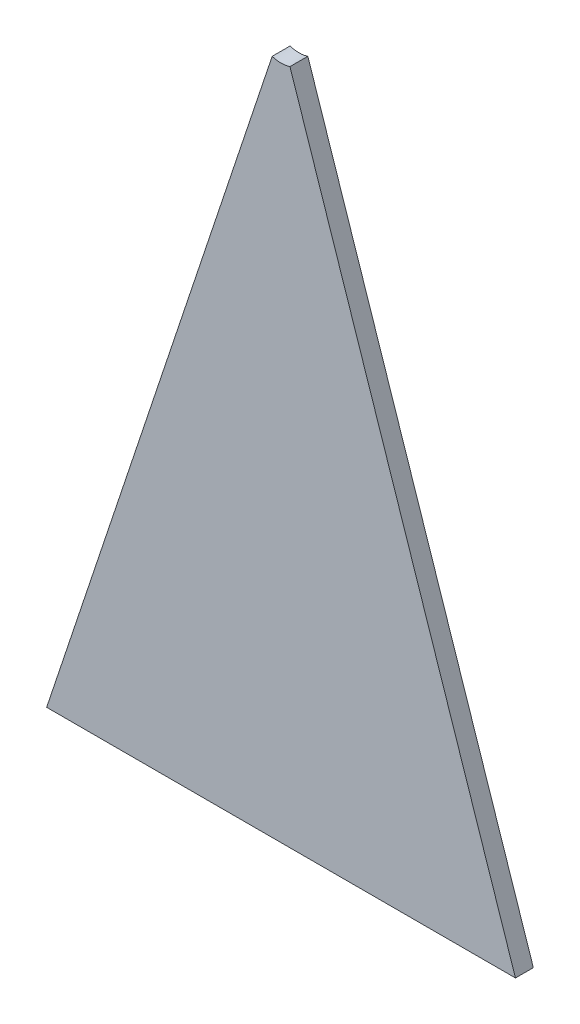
ISO-10303-21;
HEADER;
FILE_DESCRIPTION(('STEP AP214'),'2;1');
FILE_NAME('part.step','',(''),(''),'','','');
FILE_SCHEMA(('AUTOMOTIVE_DESIGN { 1 0 10303 214 1 1 1 1 }'));
ENDSEC;
DATA;
#1=APPLICATION_CONTEXT('core data for automotive mechanical design processes');
#2=APPLICATION_PROTOCOL_DEFINITION('international standard','automotive_design',2000,#1);
#3=PRODUCT_CONTEXT('',#1,'mechanical');
#4=PRODUCT('Part','Part','',(#3));
#5=PRODUCT_RELATED_PRODUCT_CATEGORY('part','',(#4));
#6=PRODUCT_DEFINITION_FORMATION('','',#4);
#7=PRODUCT_DEFINITION_CONTEXT('part definition',#1,'design');
#8=PRODUCT_DEFINITION('design','',#6,#7);
#9=PRODUCT_DEFINITION_SHAPE('','',#8);
#10=(LENGTH_UNIT() NAMED_UNIT(*) SI_UNIT(.MILLI.,.METRE.));
#11=(NAMED_UNIT(*) PLANE_ANGLE_UNIT() SI_UNIT($,.RADIAN.));
#12=(NAMED_UNIT(*) SI_UNIT($,.STERADIAN.) SOLID_ANGLE_UNIT());
#13=UNCERTAINTY_MEASURE_WITH_UNIT(LENGTH_MEASURE(1.E-05),#10,'distance_accuracy_value','');
#14=(GEOMETRIC_REPRESENTATION_CONTEXT(3) GLOBAL_UNCERTAINTY_ASSIGNED_CONTEXT((#13)) GLOBAL_UNIT_ASSIGNED_CONTEXT((#10,
#11,#12)) REPRESENTATION_CONTEXT('',''));
#15=CARTESIAN_POINT('',(0.,0.,0.));
#16=DIRECTION('',(0.,0.,1.));
#17=DIRECTION('',(1.,0.,0.));
#18=AXIS2_PLACEMENT_3D('',#15,#16,#17);
#19=CARTESIAN_POINT('',(500.,0.,19.05));
#20=DIRECTION('',(0.,1.,0.));
#21=DIRECTION('',(-1.,0.,0.));
#22=AXIS2_PLACEMENT_3D('',#19,#20,#21);
#23=PLANE('',#22);
#24=DIRECTION('',(1.,0.,0.));
#25=VECTOR('',#24,1.);
#26=CARTESIAN_POINT('',(500.,0.,0.));
#27=LINE('',#26,#25);
#28=CARTESIAN_POINT('',(0.,0.,0.));
#29=VERTEX_POINT('',#28);
#30=CARTESIAN_POINT('',(500.,0.,0.));
#31=VERTEX_POINT('',#30);
#32=EDGE_CURVE('E113',#29,#31,#27,.T.);
#33=ORIENTED_EDGE('',*,*,#32,.T.);
#34=DIRECTION('',(0.,0.,-1.));
#35=VECTOR('',#34,1.);
#36=CARTESIAN_POINT('',(500.,0.,19.05));
#37=LINE('',#36,#35);
#38=CARTESIAN_POINT('',(500.,0.,19.05));
#39=VERTEX_POINT('',#38);
#40=EDGE_CURVE('E11',#39,#31,#37,.T.);
#41=ORIENTED_EDGE('',*,*,#40,.F.);
#42=DIRECTION('',(1.,0.,0.));
#43=VECTOR('',#42,1.);
#44=CARTESIAN_POINT('',(500.,0.,19.05));
#45=LINE('',#44,#43);
#46=CARTESIAN_POINT('',(0.,0.,19.05));
#47=VERTEX_POINT('',#46);
#48=EDGE_CURVE('E97',#47,#39,#45,.T.);
#49=ORIENTED_EDGE('',*,*,#48,.F.);
#50=DIRECTION('',(0.,0.,-1.));
#51=VECTOR('',#50,1.);
#52=CARTESIAN_POINT('',(0.,0.,19.05));
#53=LINE('',#52,#51);
#54=EDGE_CURVE('E109',#47,#29,#53,.T.);
#55=ORIENTED_EDGE('',*,*,#54,.T.);
#56=EDGE_LOOP('',(#33,#41,#49,#55));
#57=FACE_BOUND('',#56,.T.);
#58=ADVANCED_FACE('F45',(#57),#23,.F.);
#59=CARTESIAN_POINT('',(259.486832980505,721.539501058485,19.05));
#60=DIRECTION('',(-0.948683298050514,-0.316227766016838,0.));
#61=DIRECTION('',(0.316227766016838,-0.948683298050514,0.));
#62=AXIS2_PLACEMENT_3D('',#59,#60,#61);
#63=PLANE('',#62);
#64=DIRECTION('',(-0.316227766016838,0.948683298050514,0.));
#65=VECTOR('',#64,1.);
#66=CARTESIAN_POINT('',(259.486832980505,721.539501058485,0.));
#67=LINE('',#66,#65);
#68=CARTESIAN_POINT('',(259.486832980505,721.539501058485,0.));
#69=VERTEX_POINT('',#68);
#70=EDGE_CURVE('E102',#31,#69,#67,.T.);
#71=ORIENTED_EDGE('',*,*,#70,.T.);
#72=DIRECTION('',(0.,0.,-1.));
#73=VECTOR('',#72,1.);
#74=CARTESIAN_POINT('',(259.486832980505,721.539501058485,19.05));
#75=LINE('',#74,#73);
#76=CARTESIAN_POINT('',(259.486832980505,721.539501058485,19.05));
#77=VERTEX_POINT('',#76);
#78=EDGE_CURVE('E54',#77,#69,#75,.T.);
#79=ORIENTED_EDGE('',*,*,#78,.F.);
#80=DIRECTION('',(-0.316227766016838,0.948683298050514,0.));
#81=VECTOR('',#80,1.);
#82=CARTESIAN_POINT('',(259.486832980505,721.539501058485,19.05));
#83=LINE('',#82,#81);
#84=EDGE_CURVE('E92',#39,#77,#83,.T.);
#85=ORIENTED_EDGE('',*,*,#84,.F.);
#86=ORIENTED_EDGE('',*,*,#40,.T.);
#87=EDGE_LOOP('',(#71,#79,#85,#86));
#88=FACE_BOUND('',#87,.T.);
#89=ADVANCED_FACE('F101',(#88),#63,.F.);
#90=CARTESIAN_POINT('',(250.,750.,19.05));
#91=DIRECTION('',(0.,0.,-1.));
#92=DIRECTION('',(-1.,0.,0.));
#93=AXIS2_PLACEMENT_3D('',#90,#91,#92);
#94=CYLINDRICAL_SURFACE('',#93,30.);
#95=CARTESIAN_POINT('',(250.,750.,0.));
#96=DIRECTION('',(0.,0.,-1.));
#97=DIRECTION('',(1.,0.,0.));
#98=AXIS2_PLACEMENT_3D('',#95,#96,#97);
#99=CIRCLE('',#98,30.);
#100=CARTESIAN_POINT('',(240.513167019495,721.539501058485,0.));
#101=VERTEX_POINT('',#100);
#102=EDGE_CURVE('E79',#69,#101,#99,.T.);
#103=ORIENTED_EDGE('',*,*,#102,.T.);
#104=DIRECTION('',(0.,0.,-1.));
#105=VECTOR('',#104,1.);
#106=CARTESIAN_POINT('',(240.513167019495,721.539501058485,19.05));
#107=LINE('',#106,#105);
#108=CARTESIAN_POINT('',(240.513167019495,721.539501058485,19.05));
#109=VERTEX_POINT('',#108);
#110=EDGE_CURVE('E104',#109,#101,#107,.T.);
#111=ORIENTED_EDGE('',*,*,#110,.F.);
#112=CARTESIAN_POINT('',(250.,750.,19.05));
#113=DIRECTION('',(0.,0.,-1.));
#114=DIRECTION('',(1.,0.,0.));
#115=AXIS2_PLACEMENT_3D('',#112,#113,#114);
#116=CIRCLE('',#115,30.);
#117=EDGE_CURVE('E95',#77,#109,#116,.T.);
#118=ORIENTED_EDGE('',*,*,#117,.F.);
#119=ORIENTED_EDGE('',*,*,#78,.T.);
#120=EDGE_LOOP('',(#103,#111,#118,#119));
#121=FACE_BOUND('',#120,.T.);
#122=ADVANCED_FACE('F105',(#121),#94,.F.);
#123=CARTESIAN_POINT('',(0.,0.,19.05));
#124=DIRECTION('',(0.948683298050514,-0.316227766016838,0.));
#125=DIRECTION('',(0.316227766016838,0.948683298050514,0.));
#126=AXIS2_PLACEMENT_3D('',#123,#124,#125);
#127=PLANE('',#126);
#128=DIRECTION('',(-0.316227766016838,-0.948683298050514,0.));
#129=VECTOR('',#128,1.);
#130=CARTESIAN_POINT('',(0.,0.,0.));
#131=LINE('',#130,#129);
#132=EDGE_CURVE('E85',#101,#29,#131,.T.);
#133=ORIENTED_EDGE('',*,*,#132,.T.);
#134=ORIENTED_EDGE('',*,*,#54,.F.);
#135=DIRECTION('',(-0.316227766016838,-0.948683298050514,0.));
#136=VECTOR('',#135,1.);
#137=CARTESIAN_POINT('',(0.,0.,19.05));
#138=LINE('',#137,#136);
#139=EDGE_CURVE('E62',#109,#47,#138,.T.);
#140=ORIENTED_EDGE('',*,*,#139,.F.);
#141=ORIENTED_EDGE('',*,*,#110,.T.);
#142=EDGE_LOOP('',(#133,#134,#140,#141));
#143=FACE_BOUND('',#142,.T.);
#144=ADVANCED_FACE('F126',(#143),#127,.F.);
#145=CARTESIAN_POINT('',(250.,750.,19.05));
#146=DIRECTION('',(0.,0.,1.));
#147=DIRECTION('',(1.,0.,0.));
#148=AXIS2_PLACEMENT_3D('',#145,#146,#147);
#149=PLANE('',#148);
#150=ORIENTED_EDGE('',*,*,#48,.T.);
#151=ORIENTED_EDGE('',*,*,#84,.T.);
#152=ORIENTED_EDGE('',*,*,#117,.T.);
#153=ORIENTED_EDGE('',*,*,#139,.T.);
#154=EDGE_LOOP('',(#150,#151,#152,#153));
#155=FACE_BOUND('',#154,.T.);
#156=ADVANCED_FACE('F93',(#155),#149,.T.);
#157=CARTESIAN_POINT('',(250.,750.,0.));
#158=DIRECTION('',(0.,0.,1.));
#159=DIRECTION('',(1.,0.,0.));
#160=AXIS2_PLACEMENT_3D('',#157,#158,#159);
#161=PLANE('',#160);
#162=ORIENTED_EDGE('',*,*,#32,.F.);
#163=ORIENTED_EDGE('',*,*,#132,.F.);
#164=ORIENTED_EDGE('',*,*,#102,.F.);
#165=ORIENTED_EDGE('',*,*,#70,.F.);
#166=EDGE_LOOP('',(#162,#163,#164,#165));
#167=FACE_BOUND('',#166,.T.);
#168=ADVANCED_FACE('F129',(#167),#161,.F.);
#169=CLOSED_SHELL('',(#58,#89,#122,#144,#156,#168));
#170=MANIFOLD_SOLID_BREP('B2',#169);
#171=ADVANCED_BREP_SHAPE_REPRESENTATION('',(#18,#170),#14);
#172=SHAPE_DEFINITION_REPRESENTATION(#9,#171);
ENDSEC;
END-ISO-10303-21;
